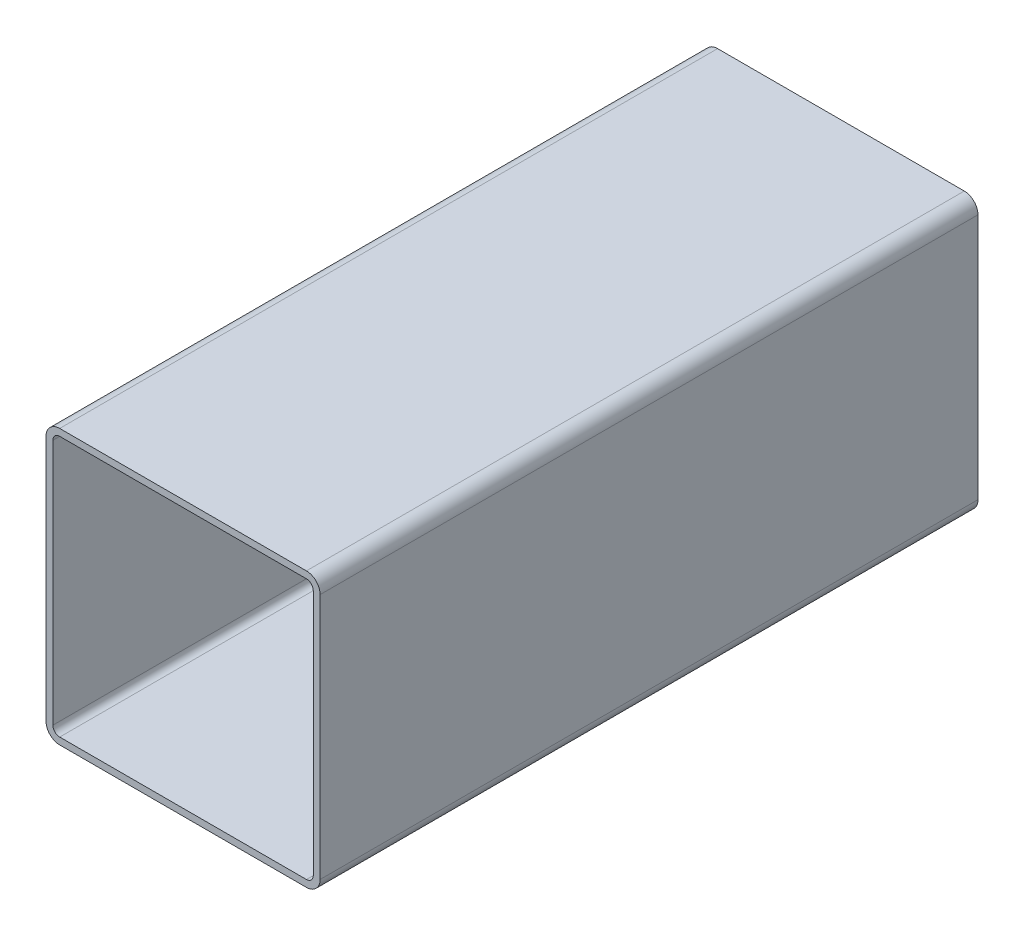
ISO-10303-21;
HEADER;
FILE_DESCRIPTION(('STEP AP214'),'2;1');
FILE_NAME('part.step','',(''),(''),'','','');
FILE_SCHEMA(('AUTOMOTIVE_DESIGN { 1 0 10303 214 1 1 1 1 }'));
ENDSEC;
DATA;
#1=APPLICATION_CONTEXT('core data for automotive mechanical design processes');
#2=APPLICATION_PROTOCOL_DEFINITION('international standard','automotive_design',2000,#1);
#3=PRODUCT_CONTEXT('',#1,'mechanical');
#4=PRODUCT('Part','Part','',(#3));
#5=PRODUCT_RELATED_PRODUCT_CATEGORY('part','',(#4));
#6=PRODUCT_DEFINITION_FORMATION('','',#4);
#7=PRODUCT_DEFINITION_CONTEXT('part definition',#1,'design');
#8=PRODUCT_DEFINITION('design','',#6,#7);
#9=PRODUCT_DEFINITION_SHAPE('','',#8);
#10=(LENGTH_UNIT() NAMED_UNIT(*) SI_UNIT(.MILLI.,.METRE.));
#11=(NAMED_UNIT(*) PLANE_ANGLE_UNIT() SI_UNIT($,.RADIAN.));
#12=(NAMED_UNIT(*) SI_UNIT($,.STERADIAN.) SOLID_ANGLE_UNIT());
#13=UNCERTAINTY_MEASURE_WITH_UNIT(LENGTH_MEASURE(1.E-05),#10,'distance_accuracy_value','');
#14=(GEOMETRIC_REPRESENTATION_CONTEXT(3) GLOBAL_UNCERTAINTY_ASSIGNED_CONTEXT((#13)) GLOBAL_UNIT_ASSIGNED_CONTEXT((#10,
#11,#12)) REPRESENTATION_CONTEXT('',''));
#15=CARTESIAN_POINT('',(0.,0.,0.));
#16=DIRECTION('',(0.,0.,1.));
#17=DIRECTION('',(1.,0.,0.));
#18=AXIS2_PLACEMENT_3D('',#15,#16,#17);
#19=CARTESIAN_POINT('',(7.21123960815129,122.68485662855,304.8));
#20=DIRECTION('',(0.,0.,1.));
#21=DIRECTION('',(1.,0.,0.));
#22=AXIS2_PLACEMENT_3D('',#19,#20,#21);
#23=PLANE('',#22);
#24=CARTESIAN_POINT('',(7.21123960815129,122.68485662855,304.8));
#25=DIRECTION('',(0.,0.,1.));
#26=DIRECTION('',(1.,0.,0.));
#27=AXIS2_PLACEMENT_3D('',#24,#25,#26);
#28=CIRCLE('',#27,6.34999999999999);
#29=CARTESIAN_POINT('',(7.2112396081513,129.03485662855,304.8));
#30=VERTEX_POINT('',#29);
#31=CARTESIAN_POINT('',(0.8612396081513,122.68485662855,304.8));
#32=VERTEX_POINT('',#31);
#33=EDGE_CURVE('E211',#30,#32,#28,.T.);
#34=ORIENTED_EDGE('',*,*,#33,.T.);
#35=DIRECTION('',(0.,-1.,0.));
#36=VECTOR('',#35,1.);
#37=CARTESIAN_POINT('',(0.8612396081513,8.38485662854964,304.8));
#38=LINE('',#37,#36);
#39=CARTESIAN_POINT('',(0.861239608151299,8.38485662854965,304.8));
#40=VERTEX_POINT('',#39);
#41=EDGE_CURVE('E214',#32,#40,#38,.T.);
#42=ORIENTED_EDGE('',*,*,#41,.T.);
#43=CARTESIAN_POINT('',(7.2112396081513,8.38485662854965,304.8));
#44=DIRECTION('',(0.,0.,1.));
#45=DIRECTION('',(1.,0.,0.));
#46=AXIS2_PLACEMENT_3D('',#43,#44,#45);
#47=CIRCLE('',#46,6.35);
#48=CARTESIAN_POINT('',(7.2112396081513,2.03485662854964,304.8));
#49=VERTEX_POINT('',#48);
#50=EDGE_CURVE('E217',#40,#49,#47,.T.);
#51=ORIENTED_EDGE('',*,*,#50,.T.);
#52=DIRECTION('',(1.,0.,0.));
#53=VECTOR('',#52,1.);
#54=CARTESIAN_POINT('',(121.511239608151,2.03485662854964,304.8));
#55=LINE('',#54,#53);
#56=CARTESIAN_POINT('',(121.511239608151,2.03485662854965,304.8));
#57=VERTEX_POINT('',#56);
#58=EDGE_CURVE('E219',#49,#57,#55,.T.);
#59=ORIENTED_EDGE('',*,*,#58,.T.);
#60=CARTESIAN_POINT('',(121.511239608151,8.38485662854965,304.8));
#61=DIRECTION('',(0.,0.,1.));
#62=DIRECTION('',(1.,0.,0.));
#63=AXIS2_PLACEMENT_3D('',#60,#61,#62);
#64=CIRCLE('',#63,6.35);
#65=CARTESIAN_POINT('',(127.861239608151,8.38485662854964,304.8));
#66=VERTEX_POINT('',#65);
#67=EDGE_CURVE('E221',#57,#66,#64,.T.);
#68=ORIENTED_EDGE('',*,*,#67,.T.);
#69=DIRECTION('',(0.,1.,0.));
#70=VECTOR('',#69,1.);
#71=CARTESIAN_POINT('',(127.861239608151,122.68485662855,304.8));
#72=LINE('',#71,#70);
#73=CARTESIAN_POINT('',(127.861239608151,122.68485662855,304.8));
#74=VERTEX_POINT('',#73);
#75=EDGE_CURVE('E223',#66,#74,#72,.T.);
#76=ORIENTED_EDGE('',*,*,#75,.T.);
#77=CARTESIAN_POINT('',(121.511239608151,122.68485662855,304.8));
#78=DIRECTION('',(0.,0.,1.));
#79=DIRECTION('',(1.,0.,0.));
#80=AXIS2_PLACEMENT_3D('',#77,#78,#79);
#81=CIRCLE('',#80,6.34999999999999);
#82=CARTESIAN_POINT('',(121.511239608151,129.03485662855,304.8));
#83=VERTEX_POINT('',#82);
#84=EDGE_CURVE('E225',#74,#83,#81,.T.);
#85=ORIENTED_EDGE('',*,*,#84,.T.);
#86=DIRECTION('',(-1.,0.,0.));
#87=VECTOR('',#86,1.);
#88=CARTESIAN_POINT('',(7.2112396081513,129.03485662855,304.8));
#89=LINE('',#88,#87);
#90=EDGE_CURVE('E227',#83,#30,#89,.T.);
#91=ORIENTED_EDGE('',*,*,#90,.T.);
#92=EDGE_LOOP('',(#34,#42,#51,#59,#68,#76,#85,#91));
#93=FACE_BOUND('',#92,.T.);
#94=DIRECTION('',(0.,-1.,0.));
#95=VECTOR('',#94,1.);
#96=CARTESIAN_POINT('',(4.0362396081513,8.38485662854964,304.8));
#97=LINE('',#96,#95);
#98=CARTESIAN_POINT('',(4.0362396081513,122.68485662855,304.8));
#99=VERTEX_POINT('',#98);
#100=CARTESIAN_POINT('',(4.0362396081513,8.38485662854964,304.8));
#101=VERTEX_POINT('',#100);
#102=EDGE_CURVE('E154',#99,#101,#97,.T.);
#103=ORIENTED_EDGE('',*,*,#102,.F.);
#104=CARTESIAN_POINT('',(7.21123960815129,122.68485662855,304.8));
#105=DIRECTION('',(0.,0.,1.));
#106=DIRECTION('',(1.,0.,0.));
#107=AXIS2_PLACEMENT_3D('',#104,#105,#106);
#108=CIRCLE('',#107,3.17499999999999);
#109=CARTESIAN_POINT('',(7.2112396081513,125.85985662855,304.8));
#110=VERTEX_POINT('',#109);
#111=EDGE_CURVE('E146',#110,#99,#108,.T.);
#112=ORIENTED_EDGE('',*,*,#111,.F.);
#113=DIRECTION('',(-1.,0.,0.));
#114=VECTOR('',#113,1.);
#115=CARTESIAN_POINT('',(7.2112396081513,125.85985662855,304.8));
#116=LINE('',#115,#114);
#117=CARTESIAN_POINT('',(121.511239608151,125.85985662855,304.8));
#118=VERTEX_POINT('',#117);
#119=EDGE_CURVE('E179',#118,#110,#116,.T.);
#120=ORIENTED_EDGE('',*,*,#119,.F.);
#121=CARTESIAN_POINT('',(121.511239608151,122.68485662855,304.8));
#122=DIRECTION('',(0.,0.,1.));
#123=DIRECTION('',(1.,0.,0.));
#124=AXIS2_PLACEMENT_3D('',#121,#122,#123);
#125=CIRCLE('',#124,3.175);
#126=CARTESIAN_POINT('',(124.686239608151,122.68485662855,304.8));
#127=VERTEX_POINT('',#126);
#128=EDGE_CURVE('E177',#127,#118,#125,.T.);
#129=ORIENTED_EDGE('',*,*,#128,.F.);
#130=DIRECTION('',(0.,1.,0.));
#131=VECTOR('',#130,1.);
#132=CARTESIAN_POINT('',(124.686239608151,122.68485662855,304.8));
#133=LINE('',#132,#131);
#134=CARTESIAN_POINT('',(124.686239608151,8.38485662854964,304.8));
#135=VERTEX_POINT('',#134);
#136=EDGE_CURVE('E175',#135,#127,#133,.T.);
#137=ORIENTED_EDGE('',*,*,#136,.F.);
#138=CARTESIAN_POINT('',(121.511239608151,8.38485662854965,304.8));
#139=DIRECTION('',(0.,0.,1.));
#140=DIRECTION('',(1.,0.,0.));
#141=AXIS2_PLACEMENT_3D('',#138,#139,#140);
#142=CIRCLE('',#141,3.175);
#143=CARTESIAN_POINT('',(121.511239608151,5.20985662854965,304.8));
#144=VERTEX_POINT('',#143);
#145=EDGE_CURVE('E173',#144,#135,#142,.T.);
#146=ORIENTED_EDGE('',*,*,#145,.F.);
#147=DIRECTION('',(1.,0.,0.));
#148=VECTOR('',#147,1.);
#149=CARTESIAN_POINT('',(121.511239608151,5.20985662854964,304.8));
#150=LINE('',#149,#148);
#151=CARTESIAN_POINT('',(7.2112396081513,5.20985662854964,304.8));
#152=VERTEX_POINT('',#151);
#153=EDGE_CURVE('E169',#152,#144,#150,.T.);
#154=ORIENTED_EDGE('',*,*,#153,.F.);
#155=CARTESIAN_POINT('',(7.2112396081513,8.38485662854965,304.8));
#156=DIRECTION('',(0.,0.,1.));
#157=DIRECTION('',(1.,0.,0.));
#158=AXIS2_PLACEMENT_3D('',#155,#156,#157);
#159=CIRCLE('',#158,3.175);
#160=EDGE_CURVE('E167',#101,#152,#159,.T.);
#161=ORIENTED_EDGE('',*,*,#160,.F.);
#162=EDGE_LOOP('',(#103,#112,#120,#129,#137,#146,#154,#161));
#163=FACE_BOUND('',#162,.T.);
#164=ADVANCED_FACE('F33',(#93,#163),#23,.T.);
#165=CARTESIAN_POINT('',(7.21123960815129,122.68485662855,0.));
#166=DIRECTION('',(0.,0.,1.));
#167=DIRECTION('',(1.,0.,0.));
#168=AXIS2_PLACEMENT_3D('',#165,#166,#167);
#169=PLANE('',#168);
#170=CARTESIAN_POINT('',(7.21123960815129,122.68485662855,0.));
#171=DIRECTION('',(0.,0.,1.));
#172=DIRECTION('',(1.,0.,0.));
#173=AXIS2_PLACEMENT_3D('',#170,#171,#172);
#174=CIRCLE('',#173,6.34999999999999);
#175=CARTESIAN_POINT('',(7.2112396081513,129.03485662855,0.));
#176=VERTEX_POINT('',#175);
#177=CARTESIAN_POINT('',(0.8612396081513,122.68485662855,0.));
#178=VERTEX_POINT('',#177);
#179=EDGE_CURVE('E162',#176,#178,#174,.T.);
#180=ORIENTED_EDGE('',*,*,#179,.F.);
#181=DIRECTION('',(-1.,0.,0.));
#182=VECTOR('',#181,1.);
#183=CARTESIAN_POINT('',(7.2112396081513,129.03485662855,0.));
#184=LINE('',#183,#182);
#185=CARTESIAN_POINT('',(121.511239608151,129.03485662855,0.));
#186=VERTEX_POINT('',#185);
#187=EDGE_CURVE('E215',#186,#176,#184,.T.);
#188=ORIENTED_EDGE('',*,*,#187,.F.);
#189=CARTESIAN_POINT('',(121.511239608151,122.68485662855,0.));
#190=DIRECTION('',(0.,0.,1.));
#191=DIRECTION('',(1.,0.,0.));
#192=AXIS2_PLACEMENT_3D('',#189,#190,#191);
#193=CIRCLE('',#192,6.34999999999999);
#194=CARTESIAN_POINT('',(127.861239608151,122.68485662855,0.));
#195=VERTEX_POINT('',#194);
#196=EDGE_CURVE('E242',#195,#186,#193,.T.);
#197=ORIENTED_EDGE('',*,*,#196,.F.);
#198=DIRECTION('',(0.,1.,0.));
#199=VECTOR('',#198,1.);
#200=CARTESIAN_POINT('',(127.861239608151,122.68485662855,0.));
#201=LINE('',#200,#199);
#202=CARTESIAN_POINT('',(127.861239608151,8.38485662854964,0.));
#203=VERTEX_POINT('',#202);
#204=EDGE_CURVE('E240',#203,#195,#201,.T.);
#205=ORIENTED_EDGE('',*,*,#204,.F.);
#206=CARTESIAN_POINT('',(121.511239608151,8.38485662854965,0.));
#207=DIRECTION('',(0.,0.,1.));
#208=DIRECTION('',(1.,0.,0.));
#209=AXIS2_PLACEMENT_3D('',#206,#207,#208);
#210=CIRCLE('',#209,6.35);
#211=CARTESIAN_POINT('',(121.511239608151,2.03485662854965,0.));
#212=VERTEX_POINT('',#211);
#213=EDGE_CURVE('E238',#212,#203,#210,.T.);
#214=ORIENTED_EDGE('',*,*,#213,.F.);
#215=DIRECTION('',(1.,0.,0.));
#216=VECTOR('',#215,1.);
#217=CARTESIAN_POINT('',(121.511239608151,2.03485662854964,0.));
#218=LINE('',#217,#216);
#219=CARTESIAN_POINT('',(7.2112396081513,2.03485662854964,0.));
#220=VERTEX_POINT('',#219);
#221=EDGE_CURVE('E236',#220,#212,#218,.T.);
#222=ORIENTED_EDGE('',*,*,#221,.F.);
#223=CARTESIAN_POINT('',(7.2112396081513,8.38485662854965,0.));
#224=DIRECTION('',(0.,0.,1.));
#225=DIRECTION('',(1.,0.,0.));
#226=AXIS2_PLACEMENT_3D('',#223,#224,#225);
#227=CIRCLE('',#226,6.35);
#228=CARTESIAN_POINT('',(0.861239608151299,8.38485662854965,0.));
#229=VERTEX_POINT('',#228);
#230=EDGE_CURVE('E234',#229,#220,#227,.T.);
#231=ORIENTED_EDGE('',*,*,#230,.F.);
#232=DIRECTION('',(0.,-1.,0.));
#233=VECTOR('',#232,1.);
#234=CARTESIAN_POINT('',(0.8612396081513,8.38485662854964,0.));
#235=LINE('',#234,#233);
#236=EDGE_CURVE('E232',#178,#229,#235,.T.);
#237=ORIENTED_EDGE('',*,*,#236,.F.);
#238=EDGE_LOOP('',(#180,#188,#197,#205,#214,#222,#231,#237));
#239=FACE_BOUND('',#238,.T.);
#240=CARTESIAN_POINT('',(7.21123960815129,122.68485662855,0.));
#241=DIRECTION('',(0.,0.,1.));
#242=DIRECTION('',(1.,0.,0.));
#243=AXIS2_PLACEMENT_3D('',#240,#241,#242);
#244=CIRCLE('',#243,3.17499999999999);
#245=CARTESIAN_POINT('',(7.2112396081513,125.85985662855,0.));
#246=VERTEX_POINT('',#245);
#247=CARTESIAN_POINT('',(4.0362396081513,122.68485662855,0.));
#248=VERTEX_POINT('',#247);
#249=EDGE_CURVE('E56',#246,#248,#244,.T.);
#250=ORIENTED_EDGE('',*,*,#249,.T.);
#251=DIRECTION('',(0.,-1.,0.));
#252=VECTOR('',#251,1.);
#253=CARTESIAN_POINT('',(4.0362396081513,8.38485662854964,0.));
#254=LINE('',#253,#252);
#255=CARTESIAN_POINT('',(4.0362396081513,8.38485662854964,0.));
#256=VERTEX_POINT('',#255);
#257=EDGE_CURVE('E161',#248,#256,#254,.T.);
#258=ORIENTED_EDGE('',*,*,#257,.T.);
#259=CARTESIAN_POINT('',(7.2112396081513,8.38485662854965,0.));
#260=DIRECTION('',(0.,0.,1.));
#261=DIRECTION('',(1.,0.,0.));
#262=AXIS2_PLACEMENT_3D('',#259,#260,#261);
#263=CIRCLE('',#262,3.175);
#264=CARTESIAN_POINT('',(7.2112396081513,5.20985662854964,0.));
#265=VERTEX_POINT('',#264);
#266=EDGE_CURVE('E183',#256,#265,#263,.T.);
#267=ORIENTED_EDGE('',*,*,#266,.T.);
#268=DIRECTION('',(1.,0.,0.));
#269=VECTOR('',#268,1.);
#270=CARTESIAN_POINT('',(121.511239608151,5.20985662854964,0.));
#271=LINE('',#270,#269);
#272=CARTESIAN_POINT('',(121.511239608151,5.20985662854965,0.));
#273=VERTEX_POINT('',#272);
#274=EDGE_CURVE('E186',#265,#273,#271,.T.);
#275=ORIENTED_EDGE('',*,*,#274,.T.);
#276=CARTESIAN_POINT('',(121.511239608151,8.38485662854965,0.));
#277=DIRECTION('',(0.,0.,1.));
#278=DIRECTION('',(1.,0.,0.));
#279=AXIS2_PLACEMENT_3D('',#276,#277,#278);
#280=CIRCLE('',#279,3.175);
#281=CARTESIAN_POINT('',(124.686239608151,8.38485662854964,0.));
#282=VERTEX_POINT('',#281);
#283=EDGE_CURVE('E189',#273,#282,#280,.T.);
#284=ORIENTED_EDGE('',*,*,#283,.T.);
#285=DIRECTION('',(0.,1.,0.));
#286=VECTOR('',#285,1.);
#287=CARTESIAN_POINT('',(124.686239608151,122.68485662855,0.));
#288=LINE('',#287,#286);
#289=CARTESIAN_POINT('',(124.686239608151,122.68485662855,0.));
#290=VERTEX_POINT('',#289);
#291=EDGE_CURVE('E192',#282,#290,#288,.T.);
#292=ORIENTED_EDGE('',*,*,#291,.T.);
#293=CARTESIAN_POINT('',(121.511239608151,122.68485662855,0.));
#294=DIRECTION('',(0.,0.,1.));
#295=DIRECTION('',(1.,0.,0.));
#296=AXIS2_PLACEMENT_3D('',#293,#294,#295);
#297=CIRCLE('',#296,3.175);
#298=CARTESIAN_POINT('',(121.511239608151,125.85985662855,0.));
#299=VERTEX_POINT('',#298);
#300=EDGE_CURVE('E195',#290,#299,#297,.T.);
#301=ORIENTED_EDGE('',*,*,#300,.T.);
#302=DIRECTION('',(-1.,0.,0.));
#303=VECTOR('',#302,1.);
#304=CARTESIAN_POINT('',(7.2112396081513,125.85985662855,0.));
#305=LINE('',#304,#303);
#306=EDGE_CURVE('E155',#299,#246,#305,.T.);
#307=ORIENTED_EDGE('',*,*,#306,.T.);
#308=EDGE_LOOP('',(#250,#258,#267,#275,#284,#292,#301,#307));
#309=FACE_BOUND('',#308,.T.);
#310=ADVANCED_FACE('F272',(#239,#309),#169,.F.);
#311=CARTESIAN_POINT('',(7.21123960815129,122.68485662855,304.8));
#312=DIRECTION('',(0.,0.,-1.));
#313=DIRECTION('',(-1.,0.,0.));
#314=AXIS2_PLACEMENT_3D('',#311,#312,#313);
#315=CYLINDRICAL_SURFACE('',#314,6.34999999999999);
#316=ORIENTED_EDGE('',*,*,#179,.T.);
#317=DIRECTION('',(0.,0.,-1.));
#318=VECTOR('',#317,1.);
#319=CARTESIAN_POINT('',(0.8612396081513,122.68485662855,304.8));
#320=LINE('',#319,#318);
#321=EDGE_CURVE('E11',#32,#178,#320,.T.);
#322=ORIENTED_EDGE('',*,*,#321,.F.);
#323=ORIENTED_EDGE('',*,*,#33,.F.);
#324=DIRECTION('',(0.,0.,-1.));
#325=VECTOR('',#324,1.);
#326=CARTESIAN_POINT('',(7.2112396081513,129.03485662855,304.8));
#327=LINE('',#326,#325);
#328=EDGE_CURVE('E229',#30,#176,#327,.T.);
#329=ORIENTED_EDGE('',*,*,#328,.T.);
#330=EDGE_LOOP('',(#316,#322,#323,#329));
#331=FACE_BOUND('',#330,.T.);
#332=ADVANCED_FACE('F35',(#331),#315,.T.);
#333=CARTESIAN_POINT('',(0.8612396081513,8.38485662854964,304.8));
#334=DIRECTION('',(1.,0.,0.));
#335=DIRECTION('',(0.,0.,-1.));
#336=AXIS2_PLACEMENT_3D('',#333,#334,#335);
#337=PLANE('',#336);
#338=ORIENTED_EDGE('',*,*,#236,.T.);
#339=DIRECTION('',(0.,0.,-1.));
#340=VECTOR('',#339,1.);
#341=CARTESIAN_POINT('',(0.861239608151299,8.38485662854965,304.8));
#342=LINE('',#341,#340);
#343=EDGE_CURVE('E41',#40,#229,#342,.T.);
#344=ORIENTED_EDGE('',*,*,#343,.F.);
#345=ORIENTED_EDGE('',*,*,#41,.F.);
#346=ORIENTED_EDGE('',*,*,#321,.T.);
#347=EDGE_LOOP('',(#338,#344,#345,#346));
#348=FACE_BOUND('',#347,.T.);
#349=ADVANCED_FACE('F289',(#348),#337,.F.);
#350=CARTESIAN_POINT('',(7.2112396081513,8.38485662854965,304.8));
#351=DIRECTION('',(0.,0.,-1.));
#352=DIRECTION('',(-1.,0.,0.));
#353=AXIS2_PLACEMENT_3D('',#350,#351,#352);
#354=CYLINDRICAL_SURFACE('',#353,6.35);
#355=ORIENTED_EDGE('',*,*,#230,.T.);
#356=DIRECTION('',(0.,0.,-1.));
#357=VECTOR('',#356,1.);
#358=CARTESIAN_POINT('',(7.2112396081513,2.03485662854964,304.8));
#359=LINE('',#358,#357);
#360=EDGE_CURVE('E259',#49,#220,#359,.T.);
#361=ORIENTED_EDGE('',*,*,#360,.F.);
#362=ORIENTED_EDGE('',*,*,#50,.F.);
#363=ORIENTED_EDGE('',*,*,#343,.T.);
#364=EDGE_LOOP('',(#355,#361,#362,#363));
#365=FACE_BOUND('',#364,.T.);
#366=ADVANCED_FACE('F266',(#365),#354,.T.);
#367=CARTESIAN_POINT('',(121.511239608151,2.03485662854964,304.8));
#368=DIRECTION('',(0.,1.,0.));
#369=DIRECTION('',(0.,0.,1.));
#370=AXIS2_PLACEMENT_3D('',#367,#368,#369);
#371=PLANE('',#370);
#372=ORIENTED_EDGE('',*,*,#221,.T.);
#373=DIRECTION('',(0.,0.,-1.));
#374=VECTOR('',#373,1.);
#375=CARTESIAN_POINT('',(121.511239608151,2.03485662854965,304.8));
#376=LINE('',#375,#374);
#377=EDGE_CURVE('E256',#57,#212,#376,.T.);
#378=ORIENTED_EDGE('',*,*,#377,.F.);
#379=ORIENTED_EDGE('',*,*,#58,.F.);
#380=ORIENTED_EDGE('',*,*,#360,.T.);
#381=EDGE_LOOP('',(#372,#378,#379,#380));
#382=FACE_BOUND('',#381,.T.);
#383=ADVANCED_FACE('F278',(#382),#371,.F.);
#384=CARTESIAN_POINT('',(121.511239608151,8.38485662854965,304.8));
#385=DIRECTION('',(0.,0.,-1.));
#386=DIRECTION('',(-1.,0.,0.));
#387=AXIS2_PLACEMENT_3D('',#384,#385,#386);
#388=CYLINDRICAL_SURFACE('',#387,6.35);
#389=ORIENTED_EDGE('',*,*,#213,.T.);
#390=DIRECTION('',(0.,0.,-1.));
#391=VECTOR('',#390,1.);
#392=CARTESIAN_POINT('',(127.861239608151,8.38485662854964,304.8));
#393=LINE('',#392,#391);
#394=EDGE_CURVE('E253',#66,#203,#393,.T.);
#395=ORIENTED_EDGE('',*,*,#394,.F.);
#396=ORIENTED_EDGE('',*,*,#67,.F.);
#397=ORIENTED_EDGE('',*,*,#377,.T.);
#398=EDGE_LOOP('',(#389,#395,#396,#397));
#399=FACE_BOUND('',#398,.T.);
#400=ADVANCED_FACE('F282',(#399),#388,.T.);
#401=CARTESIAN_POINT('',(127.861239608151,122.68485662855,304.8));
#402=DIRECTION('',(-1.,0.,0.));
#403=DIRECTION('',(0.,0.,1.));
#404=AXIS2_PLACEMENT_3D('',#401,#402,#403);
#405=PLANE('',#404);
#406=ORIENTED_EDGE('',*,*,#204,.T.);
#407=DIRECTION('',(0.,0.,-1.));
#408=VECTOR('',#407,1.);
#409=CARTESIAN_POINT('',(127.861239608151,122.68485662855,304.8));
#410=LINE('',#409,#408);
#411=EDGE_CURVE('E250',#74,#195,#410,.T.);
#412=ORIENTED_EDGE('',*,*,#411,.F.);
#413=ORIENTED_EDGE('',*,*,#75,.F.);
#414=ORIENTED_EDGE('',*,*,#394,.T.);
#415=EDGE_LOOP('',(#406,#412,#413,#414));
#416=FACE_BOUND('',#415,.T.);
#417=ADVANCED_FACE('F302',(#416),#405,.F.);
#418=CARTESIAN_POINT('',(121.511239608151,122.68485662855,304.8));
#419=DIRECTION('',(0.,0.,-1.));
#420=DIRECTION('',(-1.,0.,0.));
#421=AXIS2_PLACEMENT_3D('',#418,#419,#420);
#422=CYLINDRICAL_SURFACE('',#421,6.34999999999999);
#423=ORIENTED_EDGE('',*,*,#196,.T.);
#424=DIRECTION('',(0.,0.,-1.));
#425=VECTOR('',#424,1.);
#426=CARTESIAN_POINT('',(121.511239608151,129.03485662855,304.8));
#427=LINE('',#426,#425);
#428=EDGE_CURVE('E247',#83,#186,#427,.T.);
#429=ORIENTED_EDGE('',*,*,#428,.F.);
#430=ORIENTED_EDGE('',*,*,#84,.F.);
#431=ORIENTED_EDGE('',*,*,#411,.T.);
#432=EDGE_LOOP('',(#423,#429,#430,#431));
#433=FACE_BOUND('',#432,.T.);
#434=ADVANCED_FACE('F300',(#433),#422,.T.);
#435=CARTESIAN_POINT('',(7.2112396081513,129.03485662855,304.8));
#436=DIRECTION('',(0.,-1.,0.));
#437=DIRECTION('',(0.,0.,-1.));
#438=AXIS2_PLACEMENT_3D('',#435,#436,#437);
#439=PLANE('',#438);
#440=ORIENTED_EDGE('',*,*,#187,.T.);
#441=ORIENTED_EDGE('',*,*,#328,.F.);
#442=ORIENTED_EDGE('',*,*,#90,.F.);
#443=ORIENTED_EDGE('',*,*,#428,.T.);
#444=EDGE_LOOP('',(#440,#441,#442,#443));
#445=FACE_BOUND('',#444,.T.);
#446=ADVANCED_FACE('F295',(#445),#439,.F.);
#447=CARTESIAN_POINT('',(7.21123960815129,122.68485662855,304.8));
#448=DIRECTION('',(0.,0.,-1.));
#449=DIRECTION('',(-1.,0.,0.));
#450=AXIS2_PLACEMENT_3D('',#447,#448,#449);
#451=CYLINDRICAL_SURFACE('',#450,3.17499999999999);
#452=ORIENTED_EDGE('',*,*,#249,.F.);
#453=DIRECTION('',(0.,0.,-1.));
#454=VECTOR('',#453,1.);
#455=CARTESIAN_POINT('',(7.2112396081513,125.85985662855,304.8));
#456=LINE('',#455,#454);
#457=EDGE_CURVE('E150',#110,#246,#456,.T.);
#458=ORIENTED_EDGE('',*,*,#457,.F.);
#459=ORIENTED_EDGE('',*,*,#111,.T.);
#460=DIRECTION('',(0.,0.,-1.));
#461=VECTOR('',#460,1.);
#462=CARTESIAN_POINT('',(4.0362396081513,122.68485662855,304.8));
#463=LINE('',#462,#461);
#464=EDGE_CURVE('E149',#99,#248,#463,.T.);
#465=ORIENTED_EDGE('',*,*,#464,.T.);
#466=EDGE_LOOP('',(#452,#458,#459,#465));
#467=FACE_BOUND('',#466,.T.);
#468=ADVANCED_FACE('F148',(#467),#451,.F.);
#469=CARTESIAN_POINT('',(4.0362396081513,8.38485662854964,304.8));
#470=DIRECTION('',(1.,0.,0.));
#471=DIRECTION('',(0.,0.,-1.));
#472=AXIS2_PLACEMENT_3D('',#469,#470,#471);
#473=PLANE('',#472);
#474=ORIENTED_EDGE('',*,*,#257,.F.);
#475=ORIENTED_EDGE('',*,*,#464,.F.);
#476=ORIENTED_EDGE('',*,*,#102,.T.);
#477=DIRECTION('',(0.,0.,-1.));
#478=VECTOR('',#477,1.);
#479=CARTESIAN_POINT('',(4.0362396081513,8.38485662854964,304.8));
#480=LINE('',#479,#478);
#481=EDGE_CURVE('E163',#101,#256,#480,.T.);
#482=ORIENTED_EDGE('',*,*,#481,.T.);
#483=EDGE_LOOP('',(#474,#475,#476,#482));
#484=FACE_BOUND('',#483,.T.);
#485=ADVANCED_FACE('F158',(#484),#473,.T.);
#486=CARTESIAN_POINT('',(7.2112396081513,8.38485662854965,304.8));
#487=DIRECTION('',(0.,0.,-1.));
#488=DIRECTION('',(-1.,0.,0.));
#489=AXIS2_PLACEMENT_3D('',#486,#487,#488);
#490=CYLINDRICAL_SURFACE('',#489,3.175);
#491=ORIENTED_EDGE('',*,*,#266,.F.);
#492=ORIENTED_EDGE('',*,*,#481,.F.);
#493=ORIENTED_EDGE('',*,*,#160,.T.);
#494=DIRECTION('',(0.,0.,-1.));
#495=VECTOR('',#494,1.);
#496=CARTESIAN_POINT('',(7.2112396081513,5.20985662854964,304.8));
#497=LINE('',#496,#495);
#498=EDGE_CURVE('E208',#152,#265,#497,.T.);
#499=ORIENTED_EDGE('',*,*,#498,.T.);
#500=EDGE_LOOP('',(#491,#492,#493,#499));
#501=FACE_BOUND('',#500,.T.);
#502=ADVANCED_FACE('F327',(#501),#490,.F.);
#503=CARTESIAN_POINT('',(121.511239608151,5.20985662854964,304.8));
#504=DIRECTION('',(0.,1.,0.));
#505=DIRECTION('',(0.,0.,1.));
#506=AXIS2_PLACEMENT_3D('',#503,#504,#505);
#507=PLANE('',#506);
#508=ORIENTED_EDGE('',*,*,#274,.F.);
#509=ORIENTED_EDGE('',*,*,#498,.F.);
#510=ORIENTED_EDGE('',*,*,#153,.T.);
#511=DIRECTION('',(0.,0.,-1.));
#512=VECTOR('',#511,1.);
#513=CARTESIAN_POINT('',(121.511239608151,5.20985662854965,304.8));
#514=LINE('',#513,#512);
#515=EDGE_CURVE('E206',#144,#273,#514,.T.);
#516=ORIENTED_EDGE('',*,*,#515,.T.);
#517=EDGE_LOOP('',(#508,#509,#510,#516));
#518=FACE_BOUND('',#517,.T.);
#519=ADVANCED_FACE('F331',(#518),#507,.T.);
#520=CARTESIAN_POINT('',(121.511239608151,8.38485662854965,304.8));
#521=DIRECTION('',(0.,0.,-1.));
#522=DIRECTION('',(-1.,0.,0.));
#523=AXIS2_PLACEMENT_3D('',#520,#521,#522);
#524=CYLINDRICAL_SURFACE('',#523,3.175);
#525=ORIENTED_EDGE('',*,*,#283,.F.);
#526=ORIENTED_EDGE('',*,*,#515,.F.);
#527=ORIENTED_EDGE('',*,*,#145,.T.);
#528=DIRECTION('',(0.,0.,-1.));
#529=VECTOR('',#528,1.);
#530=CARTESIAN_POINT('',(124.686239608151,8.38485662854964,304.8));
#531=LINE('',#530,#529);
#532=EDGE_CURVE('E204',#135,#282,#531,.T.);
#533=ORIENTED_EDGE('',*,*,#532,.T.);
#534=EDGE_LOOP('',(#525,#526,#527,#533));
#535=FACE_BOUND('',#534,.T.);
#536=ADVANCED_FACE('F337',(#535),#524,.F.);
#537=CARTESIAN_POINT('',(124.686239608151,122.68485662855,304.8));
#538=DIRECTION('',(-1.,0.,0.));
#539=DIRECTION('',(0.,0.,1.));
#540=AXIS2_PLACEMENT_3D('',#537,#538,#539);
#541=PLANE('',#540);
#542=ORIENTED_EDGE('',*,*,#291,.F.);
#543=ORIENTED_EDGE('',*,*,#532,.F.);
#544=ORIENTED_EDGE('',*,*,#136,.T.);
#545=DIRECTION('',(0.,0.,-1.));
#546=VECTOR('',#545,1.);
#547=CARTESIAN_POINT('',(124.686239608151,122.68485662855,304.8));
#548=LINE('',#547,#546);
#549=EDGE_CURVE('E202',#127,#290,#548,.T.);
#550=ORIENTED_EDGE('',*,*,#549,.T.);
#551=EDGE_LOOP('',(#542,#543,#544,#550));
#552=FACE_BOUND('',#551,.T.);
#553=ADVANCED_FACE('F341',(#552),#541,.T.);
#554=CARTESIAN_POINT('',(121.511239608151,122.68485662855,304.8));
#555=DIRECTION('',(0.,0.,-1.));
#556=DIRECTION('',(-1.,0.,0.));
#557=AXIS2_PLACEMENT_3D('',#554,#555,#556);
#558=CYLINDRICAL_SURFACE('',#557,3.175);
#559=ORIENTED_EDGE('',*,*,#300,.F.);
#560=ORIENTED_EDGE('',*,*,#549,.F.);
#561=ORIENTED_EDGE('',*,*,#128,.T.);
#562=DIRECTION('',(0.,0.,-1.));
#563=VECTOR('',#562,1.);
#564=CARTESIAN_POINT('',(121.511239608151,125.85985662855,304.8));
#565=LINE('',#564,#563);
#566=EDGE_CURVE('E48',#118,#299,#565,.T.);
#567=ORIENTED_EDGE('',*,*,#566,.T.);
#568=EDGE_LOOP('',(#559,#560,#561,#567));
#569=FACE_BOUND('',#568,.T.);
#570=ADVANCED_FACE('F345',(#569),#558,.F.);
#571=CARTESIAN_POINT('',(7.2112396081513,125.85985662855,304.8));
#572=DIRECTION('',(0.,-1.,0.));
#573=DIRECTION('',(0.,0.,-1.));
#574=AXIS2_PLACEMENT_3D('',#571,#572,#573);
#575=PLANE('',#574);
#576=ORIENTED_EDGE('',*,*,#306,.F.);
#577=ORIENTED_EDGE('',*,*,#566,.F.);
#578=ORIENTED_EDGE('',*,*,#119,.T.);
#579=ORIENTED_EDGE('',*,*,#457,.T.);
#580=EDGE_LOOP('',(#576,#577,#578,#579));
#581=FACE_BOUND('',#580,.T.);
#582=ADVANCED_FACE('F349',(#581),#575,.T.);
#583=CLOSED_SHELL('',(#164,#310,#332,#349,#366,#383,#400,#417,#434,#446,#468,#485,#502,#519,
#536,#553,#570,#582));
#584=MANIFOLD_SOLID_BREP('B2',#583);
#585=ADVANCED_BREP_SHAPE_REPRESENTATION('',(#18,#584),#14);
#586=SHAPE_DEFINITION_REPRESENTATION(#9,#585);
ENDSEC;
END-ISO-10303-21;
